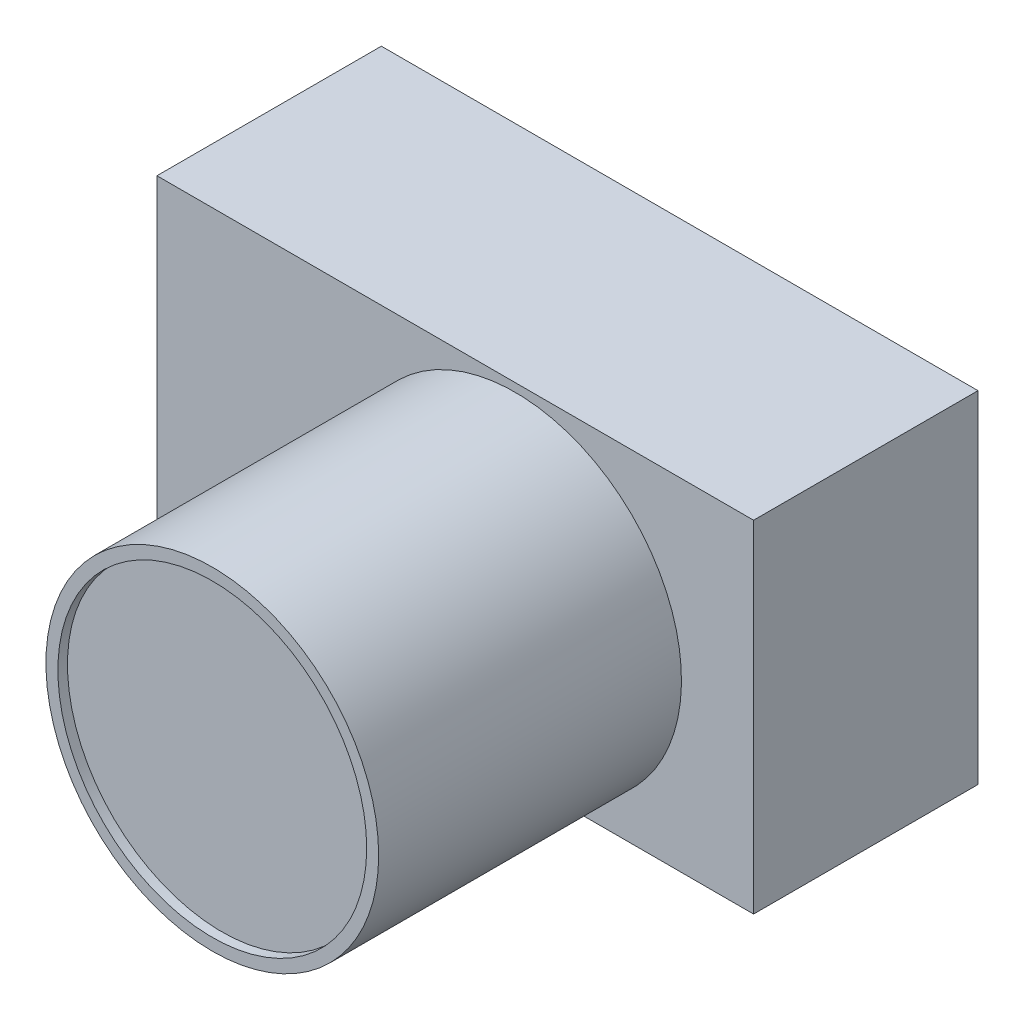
ISO-10303-21;
HEADER;
FILE_DESCRIPTION(('STEP AP214'),'2;1');
FILE_NAME('part.step','',(''),(''),'','','');
FILE_SCHEMA(('AUTOMOTIVE_DESIGN { 1 0 10303 214 1 1 1 1 }'));
ENDSEC;
DATA;
#1=APPLICATION_CONTEXT('core data for automotive mechanical design processes');
#2=APPLICATION_PROTOCOL_DEFINITION('international standard','automotive_design',2000,#1);
#3=PRODUCT_CONTEXT('',#1,'mechanical');
#4=PRODUCT('Part','Part','',(#3));
#5=PRODUCT_RELATED_PRODUCT_CATEGORY('part','',(#4));
#6=PRODUCT_DEFINITION_FORMATION('','',#4);
#7=PRODUCT_DEFINITION_CONTEXT('part definition',#1,'design');
#8=PRODUCT_DEFINITION('design','',#6,#7);
#9=PRODUCT_DEFINITION_SHAPE('','',#8);
#10=(LENGTH_UNIT() NAMED_UNIT(*) SI_UNIT(.MILLI.,.METRE.));
#11=(NAMED_UNIT(*) PLANE_ANGLE_UNIT() SI_UNIT($,.RADIAN.));
#12=(NAMED_UNIT(*) SI_UNIT($,.STERADIAN.) SOLID_ANGLE_UNIT());
#13=UNCERTAINTY_MEASURE_WITH_UNIT(LENGTH_MEASURE(1.E-05),#10,'distance_accuracy_value','');
#14=(GEOMETRIC_REPRESENTATION_CONTEXT(3) GLOBAL_UNCERTAINTY_ASSIGNED_CONTEXT((#13)) GLOBAL_UNIT_ASSIGNED_CONTEXT((#10,
#11,#12)) REPRESENTATION_CONTEXT('',''));
#15=CARTESIAN_POINT('',(0.,0.,0.));
#16=DIRECTION('',(0.,0.,1.));
#17=DIRECTION('',(1.,0.,0.));
#18=AXIS2_PLACEMENT_3D('',#15,#16,#17);
#19=CARTESIAN_POINT('',(63.3095,36.195,23.8125));
#20=DIRECTION('',(0.,0.,-1.));
#21=DIRECTION('',(-1.,0.,0.));
#22=AXIS2_PLACEMENT_3D('',#19,#20,#21);
#23=PLANE('',#22);
#24=DIRECTION('',(1.,0.,0.));
#25=VECTOR('',#24,1.);
#26=CARTESIAN_POINT('',(-63.3095,-36.195,23.8125));
#27=LINE('',#26,#25);
#28=CARTESIAN_POINT('',(-63.3095,-36.195,23.8125));
#29=VERTEX_POINT('',#28);
#30=CARTESIAN_POINT('',(12.7,-36.195,23.8125));
#31=VERTEX_POINT('',#30);
#32=EDGE_CURVE('E86',#29,#31,#27,.T.);
#33=ORIENTED_EDGE('',*,*,#32,.T.);
#34=CARTESIAN_POINT('',(12.7,-0.889000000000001,23.8125));
#35=DIRECTION('',(0.,0.,1.));
#36=DIRECTION('',(1.,0.,0.));
#37=AXIS2_PLACEMENT_3D('',#34,#35,#36);
#38=CIRCLE('',#37,35.306);
#39=EDGE_CURVE('E88',#31,#31,#38,.T.);
#40=ORIENTED_EDGE('',*,*,#39,.F.);
#41=CARTESIAN_POINT('',(63.3095,-36.195,23.8125));
#42=VERTEX_POINT('',#41);
#43=EDGE_CURVE('E50',#31,#42,#27,.T.);
#44=ORIENTED_EDGE('',*,*,#43,.T.);
#45=DIRECTION('',(0.,1.,0.));
#46=VECTOR('',#45,1.);
#47=CARTESIAN_POINT('',(63.3095,-36.195,23.8125));
#48=LINE('',#47,#46);
#49=CARTESIAN_POINT('',(63.3095,36.195,23.8125));
#50=VERTEX_POINT('',#49);
#51=EDGE_CURVE('E106',#42,#50,#48,.T.);
#52=ORIENTED_EDGE('',*,*,#51,.T.);
#53=DIRECTION('',(-1.,0.,0.));
#54=VECTOR('',#53,1.);
#55=CARTESIAN_POINT('',(-63.3095,36.195,23.8125));
#56=LINE('',#55,#54);
#57=CARTESIAN_POINT('',(-63.3095,36.195,23.8125));
#58=VERTEX_POINT('',#57);
#59=EDGE_CURVE('E82',#50,#58,#56,.T.);
#60=ORIENTED_EDGE('',*,*,#59,.T.);
#61=DIRECTION('',(0.,-1.,0.));
#62=VECTOR('',#61,1.);
#63=CARTESIAN_POINT('',(-63.3095,-36.195,23.8125));
#64=LINE('',#63,#62);
#65=EDGE_CURVE('E90',#58,#29,#64,.T.);
#66=ORIENTED_EDGE('',*,*,#65,.T.);
#67=EDGE_LOOP('',(#33,#40,#44,#52,#60,#66));
#68=FACE_BOUND('',#67,.T.);
#69=ADVANCED_FACE('F33',(#68),#23,.F.);
#70=CARTESIAN_POINT('',(63.3095,-36.195,23.8125));
#71=DIRECTION('',(-1.,0.,0.));
#72=DIRECTION('',(0.,0.,1.));
#73=AXIS2_PLACEMENT_3D('',#70,#71,#72);
#74=PLANE('',#73);
#75=DIRECTION('',(0.,1.,0.));
#76=VECTOR('',#75,1.);
#77=CARTESIAN_POINT('',(63.3095,-36.195,-23.8125));
#78=LINE('',#77,#76);
#79=CARTESIAN_POINT('',(63.3095,-36.195,-23.8125));
#80=VERTEX_POINT('',#79);
#81=CARTESIAN_POINT('',(63.3095,36.195,-23.8125));
#82=VERTEX_POINT('',#81);
#83=EDGE_CURVE('E98',#80,#82,#78,.T.);
#84=ORIENTED_EDGE('',*,*,#83,.T.);
#85=DIRECTION('',(0.,0.,-1.));
#86=VECTOR('',#85,1.);
#87=CARTESIAN_POINT('',(63.3095,36.195,23.8125));
#88=LINE('',#87,#86);
#89=EDGE_CURVE('E11',#50,#82,#88,.T.);
#90=ORIENTED_EDGE('',*,*,#89,.F.);
#91=ORIENTED_EDGE('',*,*,#51,.F.);
#92=DIRECTION('',(0.,0.,-1.));
#93=VECTOR('',#92,1.);
#94=CARTESIAN_POINT('',(63.3095,-36.195,23.8125));
#95=LINE('',#94,#93);
#96=EDGE_CURVE('E91',#42,#80,#95,.T.);
#97=ORIENTED_EDGE('',*,*,#96,.T.);
#98=EDGE_LOOP('',(#84,#90,#91,#97));
#99=FACE_BOUND('',#98,.T.);
#100=ADVANCED_FACE('F35',(#99),#74,.F.);
#101=CARTESIAN_POINT('',(-63.3095,36.195,23.8125));
#102=DIRECTION('',(0.,-1.,0.));
#103=DIRECTION('',(0.,0.,-1.));
#104=AXIS2_PLACEMENT_3D('',#101,#102,#103);
#105=PLANE('',#104);
#106=DIRECTION('',(-1.,0.,0.));
#107=VECTOR('',#106,1.);
#108=CARTESIAN_POINT('',(-63.3095,36.195,-23.8125));
#109=LINE('',#108,#107);
#110=CARTESIAN_POINT('',(-63.3095,36.195,-23.8125));
#111=VERTEX_POINT('',#110);
#112=EDGE_CURVE('E101',#82,#111,#109,.T.);
#113=ORIENTED_EDGE('',*,*,#112,.T.);
#114=DIRECTION('',(0.,0.,-1.));
#115=VECTOR('',#114,1.);
#116=CARTESIAN_POINT('',(-63.3095,36.195,23.8125));
#117=LINE('',#116,#115);
#118=EDGE_CURVE('E42',#58,#111,#117,.T.);
#119=ORIENTED_EDGE('',*,*,#118,.F.);
#120=ORIENTED_EDGE('',*,*,#59,.F.);
#121=ORIENTED_EDGE('',*,*,#89,.T.);
#122=EDGE_LOOP('',(#113,#119,#120,#121));
#123=FACE_BOUND('',#122,.T.);
#124=ADVANCED_FACE('F163',(#123),#105,.F.);
#125=CARTESIAN_POINT('',(-63.3095,-36.195,23.8125));
#126=DIRECTION('',(1.,0.,0.));
#127=DIRECTION('',(0.,0.,-1.));
#128=AXIS2_PLACEMENT_3D('',#125,#126,#127);
#129=PLANE('',#128);
#130=DIRECTION('',(0.,-1.,0.));
#131=VECTOR('',#130,1.);
#132=CARTESIAN_POINT('',(-63.3095,-36.195,-23.8125));
#133=LINE('',#132,#131);
#134=CARTESIAN_POINT('',(-63.3095,-36.195,-23.8125));
#135=VERTEX_POINT('',#134);
#136=EDGE_CURVE('E69',#111,#135,#133,.T.);
#137=ORIENTED_EDGE('',*,*,#136,.T.);
#138=DIRECTION('',(0.,0.,-1.));
#139=VECTOR('',#138,1.);
#140=CARTESIAN_POINT('',(-63.3095,-36.195,23.8125));
#141=LINE('',#140,#139);
#142=EDGE_CURVE('E108',#29,#135,#141,.T.);
#143=ORIENTED_EDGE('',*,*,#142,.F.);
#144=ORIENTED_EDGE('',*,*,#65,.F.);
#145=ORIENTED_EDGE('',*,*,#118,.T.);
#146=EDGE_LOOP('',(#137,#143,#144,#145));
#147=FACE_BOUND('',#146,.T.);
#148=ADVANCED_FACE('F109',(#147),#129,.F.);
#149=CARTESIAN_POINT('',(-63.3095,-36.195,23.8125));
#150=DIRECTION('',(0.,1.,0.));
#151=DIRECTION('',(0.,0.,1.));
#152=AXIS2_PLACEMENT_3D('',#149,#150,#151);
#153=PLANE('',#152);
#154=CARTESIAN_POINT('',(12.7,-36.195,0.));
#155=DIRECTION('',(0.,-1.,0.));
#156=DIRECTION('',(0.,0.,-1.));
#157=AXIS2_PLACEMENT_3D('',#154,#155,#156);
#158=CIRCLE('',#157,3.175);
#159=CARTESIAN_POINT('',(12.7,-36.195,-3.175));
#160=VERTEX_POINT('',#159);
#161=EDGE_CURVE('E117',#160,#160,#158,.T.);
#162=ORIENTED_EDGE('',*,*,#161,.F.);
#163=EDGE_LOOP('',(#162));
#164=FACE_BOUND('',#163,.T.);
#165=DIRECTION('',(1.,0.,0.));
#166=VECTOR('',#165,1.);
#167=CARTESIAN_POINT('',(-63.3095,-36.195,-23.8125));
#168=LINE('',#167,#166);
#169=EDGE_CURVE('E75',#135,#80,#168,.T.);
#170=ORIENTED_EDGE('',*,*,#169,.T.);
#171=ORIENTED_EDGE('',*,*,#96,.F.);
#172=ORIENTED_EDGE('',*,*,#43,.F.);
#173=ORIENTED_EDGE('',*,*,#32,.F.);
#174=ORIENTED_EDGE('',*,*,#142,.T.);
#175=EDGE_LOOP('',(#170,#171,#172,#173,#174));
#176=FACE_BOUND('',#175,.T.);
#177=ADVANCED_FACE('F93',(#164,#176),#153,.F.);
#178=CARTESIAN_POINT('',(63.3095,36.195,-23.8125));
#179=DIRECTION('',(0.,0.,-1.));
#180=DIRECTION('',(-1.,0.,0.));
#181=AXIS2_PLACEMENT_3D('',#178,#179,#180);
#182=PLANE('',#181);
#183=ORIENTED_EDGE('',*,*,#83,.F.);
#184=ORIENTED_EDGE('',*,*,#169,.F.);
#185=ORIENTED_EDGE('',*,*,#136,.F.);
#186=ORIENTED_EDGE('',*,*,#112,.F.);
#187=EDGE_LOOP('',(#183,#184,#185,#186));
#188=FACE_BOUND('',#187,.T.);
#189=ADVANCED_FACE('F112',(#188),#182,.T.);
#190=CARTESIAN_POINT('',(12.7,-29.845,0.));
#191=DIRECTION('',(0.,-1.,0.));
#192=DIRECTION('',(0.,0.,-1.));
#193=AXIS2_PLACEMENT_3D('',#190,#191,#192);
#194=CYLINDRICAL_SURFACE('',#193,3.175);
#195=CARTESIAN_POINT('',(12.7,-29.845,0.));
#196=DIRECTION('',(0.,-1.,0.));
#197=DIRECTION('',(0.,0.,-1.));
#198=AXIS2_PLACEMENT_3D('',#195,#196,#197);
#199=CIRCLE('',#198,3.175);
#200=CARTESIAN_POINT('',(12.7,-29.845,-3.175));
#201=VERTEX_POINT('',#200);
#202=EDGE_CURVE('E102',#201,#201,#199,.T.);
#203=ORIENTED_EDGE('',*,*,#202,.F.);
#204=EDGE_LOOP('',(#203));
#205=FACE_BOUND('',#204,.T.);
#206=ORIENTED_EDGE('',*,*,#161,.T.);
#207=EDGE_LOOP('',(#206));
#208=FACE_BOUND('',#207,.T.);
#209=ADVANCED_FACE('F155',(#205,#208),#194,.F.);
#210=CARTESIAN_POINT('',(12.7,-29.845,0.));
#211=DIRECTION('',(0.,-1.,0.));
#212=DIRECTION('',(0.,0.,-1.));
#213=AXIS2_PLACEMENT_3D('',#210,#211,#212);
#214=PLANE('',#213);
#215=ORIENTED_EDGE('',*,*,#202,.T.);
#216=EDGE_LOOP('',(#215));
#217=FACE_BOUND('',#216,.T.);
#218=ADVANCED_FACE('F150',(#217),#214,.T.);
#219=CARTESIAN_POINT('',(12.7,-0.889000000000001,88.0745));
#220=DIRECTION('',(0.,0.,-1.));
#221=DIRECTION('',(-1.,0.,0.));
#222=AXIS2_PLACEMENT_3D('',#219,#220,#221);
#223=CYLINDRICAL_SURFACE('',#222,35.306);
#224=CARTESIAN_POINT('',(12.7,-0.889000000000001,88.0745));
#225=DIRECTION('',(0.,0.,1.));
#226=DIRECTION('',(1.,0.,0.));
#227=AXIS2_PLACEMENT_3D('',#224,#225,#226);
#228=CIRCLE('',#227,35.306);
#229=CARTESIAN_POINT('',(48.006,-0.889000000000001,88.0745));
#230=VERTEX_POINT('',#229);
#231=EDGE_CURVE('E120',#230,#230,#228,.T.);
#232=ORIENTED_EDGE('',*,*,#231,.F.);
#233=EDGE_LOOP('',(#232));
#234=FACE_BOUND('',#233,.T.);
#235=ORIENTED_EDGE('',*,*,#39,.T.);
#236=EDGE_LOOP('',(#235));
#237=FACE_BOUND('',#236,.T.);
#238=ADVANCED_FACE('F144',(#234,#237),#223,.T.);
#239=CARTESIAN_POINT('',(12.7,-0.889000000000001,88.0745));
#240=DIRECTION('',(0.,0.,1.));
#241=DIRECTION('',(1.,0.,0.));
#242=AXIS2_PLACEMENT_3D('',#239,#240,#241);
#243=PLANE('',#242);
#244=CARTESIAN_POINT('',(12.7,-0.889000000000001,88.0745));
#245=DIRECTION('',(0.,0.,1.));
#246=DIRECTION('',(1.,0.,0.));
#247=AXIS2_PLACEMENT_3D('',#244,#245,#246);
#248=CIRCLE('',#247,32.766);
#249=CARTESIAN_POINT('',(45.466,-0.889000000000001,88.0745));
#250=VERTEX_POINT('',#249);
#251=EDGE_CURVE('E127',#250,#250,#248,.T.);
#252=ORIENTED_EDGE('',*,*,#251,.F.);
#253=EDGE_LOOP('',(#252));
#254=FACE_BOUND('',#253,.T.);
#255=ORIENTED_EDGE('',*,*,#231,.T.);
#256=EDGE_LOOP('',(#255));
#257=FACE_BOUND('',#256,.T.);
#258=ADVANCED_FACE('F138',(#254,#257),#243,.T.);
#259=CARTESIAN_POINT('',(12.7,-0.889000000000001,86.0425));
#260=DIRECTION('',(0.,0.,1.));
#261=DIRECTION('',(1.,0.,0.));
#262=AXIS2_PLACEMENT_3D('',#259,#260,#261);
#263=CYLINDRICAL_SURFACE('',#262,32.766);
#264=CARTESIAN_POINT('',(12.7,-0.889000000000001,86.0425));
#265=DIRECTION('',(0.,0.,1.));
#266=DIRECTION('',(1.,0.,0.));
#267=AXIS2_PLACEMENT_3D('',#264,#265,#266);
#268=CIRCLE('',#267,32.766);
#269=CARTESIAN_POINT('',(45.466,-0.889000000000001,86.0425));
#270=VERTEX_POINT('',#269);
#271=EDGE_CURVE('E124',#270,#270,#268,.T.);
#272=ORIENTED_EDGE('',*,*,#271,.F.);
#273=EDGE_LOOP('',(#272));
#274=FACE_BOUND('',#273,.T.);
#275=ORIENTED_EDGE('',*,*,#251,.T.);
#276=EDGE_LOOP('',(#275));
#277=FACE_BOUND('',#276,.T.);
#278=ADVANCED_FACE('F135',(#274,#277),#263,.F.);
#279=CARTESIAN_POINT('',(12.7,-0.889000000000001,86.0425));
#280=DIRECTION('',(0.,0.,1.));
#281=DIRECTION('',(1.,0.,0.));
#282=AXIS2_PLACEMENT_3D('',#279,#280,#281);
#283=PLANE('',#282);
#284=ORIENTED_EDGE('',*,*,#271,.T.);
#285=EDGE_LOOP('',(#284));
#286=FACE_BOUND('',#285,.T.);
#287=ADVANCED_FACE('F133',(#286),#283,.T.);
#288=CLOSED_SHELL('',(#69,#100,#124,#148,#177,#189,#209,#218,#238,#258,#278,#287));
#289=MANIFOLD_SOLID_BREP('B2',#288);
#290=ADVANCED_BREP_SHAPE_REPRESENTATION('',(#18,#289),#14);
#291=SHAPE_DEFINITION_REPRESENTATION(#9,#290);
ENDSEC;
END-ISO-10303-21;
